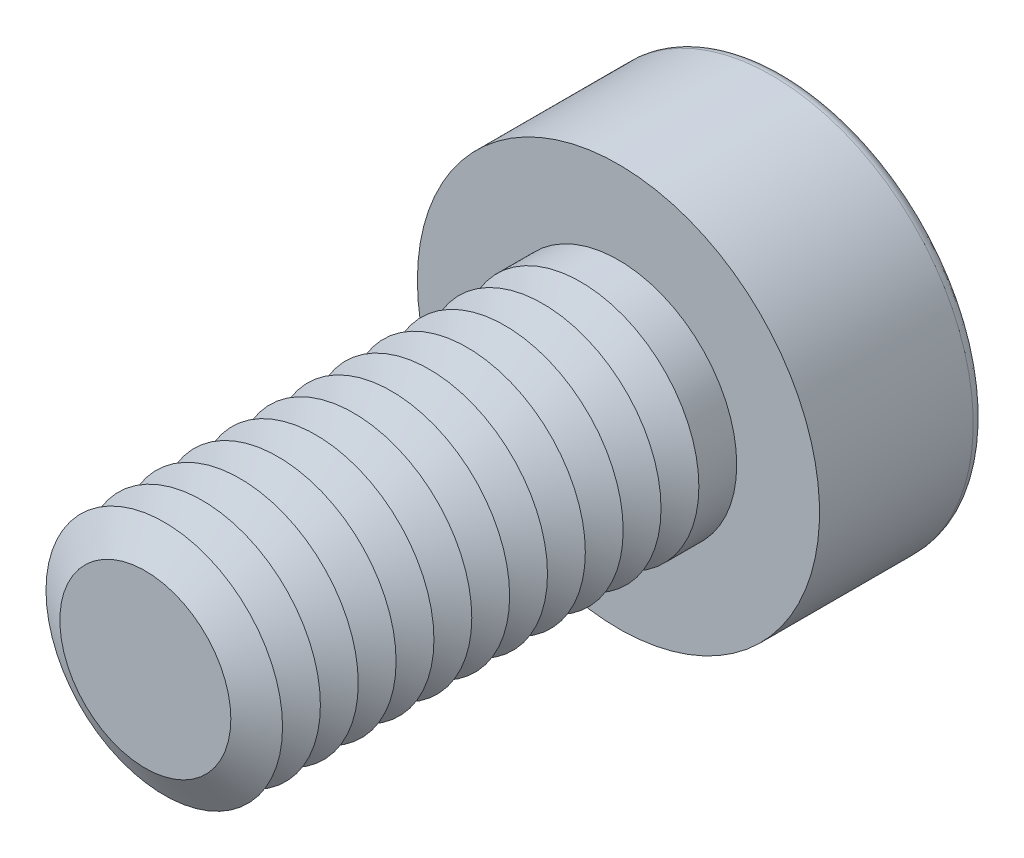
ISO-10303-21;
HEADER;
FILE_DESCRIPTION(('STEP AP214'),'2;1');
FILE_NAME('part.step','',(''),(''),'','','');
FILE_SCHEMA(('AUTOMOTIVE_DESIGN { 1 0 10303 214 1 1 1 1 }'));
ENDSEC;
DATA;
#1=APPLICATION_CONTEXT('core data for automotive mechanical design processes');
#2=APPLICATION_PROTOCOL_DEFINITION('international standard','automotive_design',2000,#1);
#3=PRODUCT_CONTEXT('',#1,'mechanical');
#4=PRODUCT('Part','Part','',(#3));
#5=PRODUCT_RELATED_PRODUCT_CATEGORY('part','',(#4));
#6=PRODUCT_DEFINITION_FORMATION('','',#4);
#7=PRODUCT_DEFINITION_CONTEXT('part definition',#1,'design');
#8=PRODUCT_DEFINITION('design','',#6,#7);
#9=PRODUCT_DEFINITION_SHAPE('','',#8);
#10=(LENGTH_UNIT() NAMED_UNIT(*) SI_UNIT(.MILLI.,.METRE.));
#11=(NAMED_UNIT(*) PLANE_ANGLE_UNIT() SI_UNIT($,.RADIAN.));
#12=(NAMED_UNIT(*) SI_UNIT($,.STERADIAN.) SOLID_ANGLE_UNIT());
#13=UNCERTAINTY_MEASURE_WITH_UNIT(LENGTH_MEASURE(1.E-05),#10,'distance_accuracy_value','');
#14=(GEOMETRIC_REPRESENTATION_CONTEXT(3) GLOBAL_UNCERTAINTY_ASSIGNED_CONTEXT((#13)) GLOBAL_UNIT_ASSIGNED_CONTEXT((#10,
#11,#12)) REPRESENTATION_CONTEXT('',''));
#15=CARTESIAN_POINT('',(0.,0.,0.));
#16=DIRECTION('',(0.,0.,1.));
#17=DIRECTION('',(1.,0.,0.));
#18=AXIS2_PLACEMENT_3D('',#15,#16,#17);
#19=CARTESIAN_POINT('',(0.,0.,7.2));
#20=DIRECTION('',(0.,0.,1.));
#21=DIRECTION('',(1.,0.,0.));
#22=AXIS2_PLACEMENT_3D('',#19,#20,#21);
#23=CONICAL_SURFACE('',#22,2.5,1.0471975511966);
#24=CARTESIAN_POINT('',(0.,0.,6.8));
#25=DIRECTION('',(0.,0.,1.));
#26=DIRECTION('',(1.,0.,0.));
#27=AXIS2_PLACEMENT_3D('',#24,#25,#26);
#28=CIRCLE('',#27,1.80717967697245);
#29=CARTESIAN_POINT('',(1.80717967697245,0.,6.8));
#30=VERTEX_POINT('',#29);
#31=EDGE_CURVE('E313',#30,#30,#28,.T.);
#32=ORIENTED_EDGE('',*,*,#31,.T.);
#33=EDGE_LOOP('',(#32));
#34=FACE_BOUND('',#33,.T.);
#35=CARTESIAN_POINT('',(0.,0.,7.2));
#36=DIRECTION('',(0.,0.,1.));
#37=DIRECTION('',(1.,0.,0.));
#38=AXIS2_PLACEMENT_3D('',#35,#36,#37);
#39=CIRCLE('',#38,2.5);
#40=CARTESIAN_POINT('',(2.5,0.,7.2));
#41=VERTEX_POINT('',#40);
#42=EDGE_CURVE('E316',#41,#41,#39,.T.);
#43=ORIENTED_EDGE('',*,*,#42,.F.);
#44=EDGE_LOOP('',(#43));
#45=FACE_BOUND('',#44,.T.);
#46=ADVANCED_FACE('F39',(#34,#45),#23,.T.);
#47=CARTESIAN_POINT('',(0.,0.,6.8));
#48=DIRECTION('',(0.,0.,-1.));
#49=DIRECTION('',(-1.,0.,0.));
#50=AXIS2_PLACEMENT_3D('',#47,#48,#49);
#51=CONICAL_SURFACE('',#50,1.80717967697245,1.0471975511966);
#52=CARTESIAN_POINT('',(0.,0.,6.4));
#53=DIRECTION('',(0.,0.,1.));
#54=DIRECTION('',(1.,0.,0.));
#55=AXIS2_PLACEMENT_3D('',#52,#53,#54);
#56=CIRCLE('',#55,2.5);
#57=CARTESIAN_POINT('',(2.5,0.,6.4));
#58=VERTEX_POINT('',#57);
#59=EDGE_CURVE('E324',#58,#58,#56,.T.);
#60=ORIENTED_EDGE('',*,*,#59,.T.);
#61=EDGE_LOOP('',(#60));
#62=FACE_BOUND('',#61,.T.);
#63=ORIENTED_EDGE('',*,*,#31,.F.);
#64=EDGE_LOOP('',(#63));
#65=FACE_BOUND('',#64,.T.);
#66=ADVANCED_FACE('F244',(#62,#65),#51,.T.);
#67=CARTESIAN_POINT('',(0.,0.,10.));
#68=DIRECTION('',(0.,0.,1.));
#69=DIRECTION('',(1.,0.,0.));
#70=AXIS2_PLACEMENT_3D('',#67,#68,#69);
#71=PLANE('',#70);
#72=CARTESIAN_POINT('',(0.,0.,10.));
#73=DIRECTION('',(0.,0.,1.));
#74=DIRECTION('',(1.,0.,0.));
#75=AXIS2_PLACEMENT_3D('',#72,#73,#74);
#76=CIRCLE('',#75,1.80717967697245);
#77=CARTESIAN_POINT('',(1.80717967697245,0.,10.));
#78=VERTEX_POINT('',#77);
#79=EDGE_CURVE('E173',#78,#78,#76,.T.);
#80=ORIENTED_EDGE('',*,*,#79,.T.);
#81=EDGE_LOOP('',(#80));
#82=FACE_BOUND('',#81,.T.);
#83=ADVANCED_FACE('F250',(#82),#71,.T.);
#84=CARTESIAN_POINT('',(0.,0.,10.));
#85=DIRECTION('',(0.,0.,-1.));
#86=DIRECTION('',(-1.,0.,0.));
#87=AXIS2_PLACEMENT_3D('',#84,#85,#86);
#88=CONICAL_SURFACE('',#87,1.80717967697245,1.0471975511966);
#89=CARTESIAN_POINT('',(0.,0.,9.6));
#90=DIRECTION('',(0.,0.,1.));
#91=DIRECTION('',(1.,0.,0.));
#92=AXIS2_PLACEMENT_3D('',#89,#90,#91);
#93=CIRCLE('',#92,2.5);
#94=CARTESIAN_POINT('',(2.5,0.,9.6));
#95=VERTEX_POINT('',#94);
#96=EDGE_CURVE('E290',#95,#95,#93,.T.);
#97=ORIENTED_EDGE('',*,*,#96,.T.);
#98=EDGE_LOOP('',(#97));
#99=FACE_BOUND('',#98,.T.);
#100=ORIENTED_EDGE('',*,*,#79,.F.);
#101=EDGE_LOOP('',(#100));
#102=FACE_BOUND('',#101,.T.);
#103=ADVANCED_FACE('F198',(#99,#102),#88,.T.);
#104=CARTESIAN_POINT('',(0.,0.,9.6));
#105=DIRECTION('',(0.,0.,1.));
#106=DIRECTION('',(1.,0.,0.));
#107=AXIS2_PLACEMENT_3D('',#104,#105,#106);
#108=CONICAL_SURFACE('',#107,2.5,1.0471975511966);
#109=CARTESIAN_POINT('',(0.,0.,9.2));
#110=DIRECTION('',(0.,0.,1.));
#111=DIRECTION('',(1.,0.,0.));
#112=AXIS2_PLACEMENT_3D('',#109,#110,#111);
#113=CIRCLE('',#112,1.80717967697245);
#114=CARTESIAN_POINT('',(1.80717967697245,0.,9.2));
#115=VERTEX_POINT('',#114);
#116=EDGE_CURVE('E287',#115,#115,#113,.T.);
#117=ORIENTED_EDGE('',*,*,#116,.T.);
#118=EDGE_LOOP('',(#117));
#119=FACE_BOUND('',#118,.T.);
#120=ORIENTED_EDGE('',*,*,#96,.F.);
#121=EDGE_LOOP('',(#120));
#122=FACE_BOUND('',#121,.T.);
#123=ADVANCED_FACE('F276',(#119,#122),#108,.T.);
#124=CARTESIAN_POINT('',(0.,0.,9.2));
#125=DIRECTION('',(0.,0.,-1.));
#126=DIRECTION('',(-1.,0.,0.));
#127=AXIS2_PLACEMENT_3D('',#124,#125,#126);
#128=CONICAL_SURFACE('',#127,1.80717967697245,1.0471975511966);
#129=CARTESIAN_POINT('',(0.,0.,8.8));
#130=DIRECTION('',(0.,0.,1.));
#131=DIRECTION('',(1.,0.,0.));
#132=AXIS2_PLACEMENT_3D('',#129,#130,#131);
#133=CIRCLE('',#132,2.5);
#134=CARTESIAN_POINT('',(2.5,0.,8.8));
#135=VERTEX_POINT('',#134);
#136=EDGE_CURVE('E299',#135,#135,#133,.T.);
#137=ORIENTED_EDGE('',*,*,#136,.T.);
#138=EDGE_LOOP('',(#137));
#139=FACE_BOUND('',#138,.T.);
#140=ORIENTED_EDGE('',*,*,#116,.F.);
#141=EDGE_LOOP('',(#140));
#142=FACE_BOUND('',#141,.T.);
#143=ADVANCED_FACE('F273',(#139,#142),#128,.T.);
#144=CARTESIAN_POINT('',(0.,0.,8.8));
#145=DIRECTION('',(0.,0.,1.));
#146=DIRECTION('',(1.,0.,0.));
#147=AXIS2_PLACEMENT_3D('',#144,#145,#146);
#148=CONICAL_SURFACE('',#147,2.5,1.0471975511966);
#149=CARTESIAN_POINT('',(0.,0.,8.4));
#150=DIRECTION('',(0.,0.,1.));
#151=DIRECTION('',(1.,0.,0.));
#152=AXIS2_PLACEMENT_3D('',#149,#150,#151);
#153=CIRCLE('',#152,1.80717967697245);
#154=CARTESIAN_POINT('',(1.80717967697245,0.,8.4));
#155=VERTEX_POINT('',#154);
#156=EDGE_CURVE('E292',#155,#155,#153,.T.);
#157=ORIENTED_EDGE('',*,*,#156,.T.);
#158=EDGE_LOOP('',(#157));
#159=FACE_BOUND('',#158,.T.);
#160=ORIENTED_EDGE('',*,*,#136,.F.);
#161=EDGE_LOOP('',(#160));
#162=FACE_BOUND('',#161,.T.);
#163=ADVANCED_FACE('F269',(#159,#162),#148,.T.);
#164=CARTESIAN_POINT('',(0.,0.,8.4));
#165=DIRECTION('',(0.,0.,-1.));
#166=DIRECTION('',(-1.,0.,0.));
#167=AXIS2_PLACEMENT_3D('',#164,#165,#166);
#168=CONICAL_SURFACE('',#167,1.80717967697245,1.0471975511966);
#169=CARTESIAN_POINT('',(0.,0.,8.));
#170=DIRECTION('',(0.,0.,1.));
#171=DIRECTION('',(1.,0.,0.));
#172=AXIS2_PLACEMENT_3D('',#169,#170,#171);
#173=CIRCLE('',#172,2.5);
#174=CARTESIAN_POINT('',(2.5,0.,8.));
#175=VERTEX_POINT('',#174);
#176=EDGE_CURVE('E309',#175,#175,#173,.T.);
#177=ORIENTED_EDGE('',*,*,#176,.T.);
#178=EDGE_LOOP('',(#177));
#179=FACE_BOUND('',#178,.T.);
#180=ORIENTED_EDGE('',*,*,#156,.F.);
#181=EDGE_LOOP('',(#180));
#182=FACE_BOUND('',#181,.T.);
#183=ADVANCED_FACE('F265',(#179,#182),#168,.T.);
#184=CARTESIAN_POINT('',(0.,0.,8.));
#185=DIRECTION('',(0.,0.,1.));
#186=DIRECTION('',(1.,0.,0.));
#187=AXIS2_PLACEMENT_3D('',#184,#185,#186);
#188=CONICAL_SURFACE('',#187,2.5,1.0471975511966);
#189=CARTESIAN_POINT('',(0.,0.,7.6));
#190=DIRECTION('',(0.,0.,1.));
#191=DIRECTION('',(1.,0.,0.));
#192=AXIS2_PLACEMENT_3D('',#189,#190,#191);
#193=CIRCLE('',#192,1.80717967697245);
#194=CARTESIAN_POINT('',(1.80717967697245,0.,7.6));
#195=VERTEX_POINT('',#194);
#196=EDGE_CURVE('E305',#195,#195,#193,.T.);
#197=ORIENTED_EDGE('',*,*,#196,.T.);
#198=EDGE_LOOP('',(#197));
#199=FACE_BOUND('',#198,.T.);
#200=ORIENTED_EDGE('',*,*,#176,.F.);
#201=EDGE_LOOP('',(#200));
#202=FACE_BOUND('',#201,.T.);
#203=ADVANCED_FACE('F261',(#199,#202),#188,.T.);
#204=CARTESIAN_POINT('',(0.,0.,7.6));
#205=DIRECTION('',(0.,0.,-1.));
#206=DIRECTION('',(-1.,0.,0.));
#207=AXIS2_PLACEMENT_3D('',#204,#205,#206);
#208=CONICAL_SURFACE('',#207,1.80717967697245,1.0471975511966);
#209=ORIENTED_EDGE('',*,*,#42,.T.);
#210=EDGE_LOOP('',(#209));
#211=FACE_BOUND('',#210,.T.);
#212=ORIENTED_EDGE('',*,*,#196,.F.);
#213=EDGE_LOOP('',(#212));
#214=FACE_BOUND('',#213,.T.);
#215=ADVANCED_FACE('F257',(#211,#214),#208,.T.);
#216=CARTESIAN_POINT('',(0.,0.,6.4));
#217=DIRECTION('',(0.,0.,1.));
#218=DIRECTION('',(1.,0.,0.));
#219=AXIS2_PLACEMENT_3D('',#216,#217,#218);
#220=CONICAL_SURFACE('',#219,2.5,1.0471975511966);
#221=CARTESIAN_POINT('',(0.,0.,6.));
#222=DIRECTION('',(0.,0.,1.));
#223=DIRECTION('',(1.,0.,0.));
#224=AXIS2_PLACEMENT_3D('',#221,#222,#223);
#225=CIRCLE('',#224,1.80717967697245);
#226=CARTESIAN_POINT('',(1.80717967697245,0.,6.));
#227=VERTEX_POINT('',#226);
#228=EDGE_CURVE('E320',#227,#227,#225,.T.);
#229=ORIENTED_EDGE('',*,*,#228,.T.);
#230=EDGE_LOOP('',(#229));
#231=FACE_BOUND('',#230,.T.);
#232=ORIENTED_EDGE('',*,*,#59,.F.);
#233=EDGE_LOOP('',(#232));
#234=FACE_BOUND('',#233,.T.);
#235=ADVANCED_FACE('F260',(#231,#234),#220,.T.);
#236=CARTESIAN_POINT('',(0.,0.,6.));
#237=DIRECTION('',(0.,0.,-1.));
#238=DIRECTION('',(-1.,0.,0.));
#239=AXIS2_PLACEMENT_3D('',#236,#237,#238);
#240=CONICAL_SURFACE('',#239,1.80717967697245,1.0471975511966);
#241=CARTESIAN_POINT('',(0.,0.,5.6));
#242=DIRECTION('',(0.,0.,1.));
#243=DIRECTION('',(1.,0.,0.));
#244=AXIS2_PLACEMENT_3D('',#241,#242,#243);
#245=CIRCLE('',#244,2.5);
#246=CARTESIAN_POINT('',(2.5,0.,5.6));
#247=VERTEX_POINT('',#246);
#248=EDGE_CURVE('E332',#247,#247,#245,.T.);
#249=ORIENTED_EDGE('',*,*,#248,.T.);
#250=EDGE_LOOP('',(#249));
#251=FACE_BOUND('',#250,.T.);
#252=ORIENTED_EDGE('',*,*,#228,.F.);
#253=EDGE_LOOP('',(#252));
#254=FACE_BOUND('',#253,.T.);
#255=ADVANCED_FACE('F431',(#251,#254),#240,.T.);
#256=CARTESIAN_POINT('',(0.,0.,5.6));
#257=DIRECTION('',(0.,0.,1.));
#258=DIRECTION('',(1.,0.,0.));
#259=AXIS2_PLACEMENT_3D('',#256,#257,#258);
#260=CONICAL_SURFACE('',#259,2.5,1.0471975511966);
#261=CARTESIAN_POINT('',(0.,0.,5.2));
#262=DIRECTION('',(0.,0.,1.));
#263=DIRECTION('',(1.,0.,0.));
#264=AXIS2_PLACEMENT_3D('',#261,#262,#263);
#265=CIRCLE('',#264,1.80717967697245);
#266=CARTESIAN_POINT('',(1.80717967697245,0.,5.2));
#267=VERTEX_POINT('',#266);
#268=EDGE_CURVE('E328',#267,#267,#265,.T.);
#269=ORIENTED_EDGE('',*,*,#268,.T.);
#270=EDGE_LOOP('',(#269));
#271=FACE_BOUND('',#270,.T.);
#272=ORIENTED_EDGE('',*,*,#248,.F.);
#273=EDGE_LOOP('',(#272));
#274=FACE_BOUND('',#273,.T.);
#275=ADVANCED_FACE('F427',(#271,#274),#260,.T.);
#276=CARTESIAN_POINT('',(0.,0.,5.2));
#277=DIRECTION('',(0.,0.,-1.));
#278=DIRECTION('',(-1.,0.,0.));
#279=AXIS2_PLACEMENT_3D('',#276,#277,#278);
#280=CONICAL_SURFACE('',#279,1.80717967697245,1.0471975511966);
#281=CARTESIAN_POINT('',(0.,0.,4.8));
#282=DIRECTION('',(0.,0.,1.));
#283=DIRECTION('',(1.,0.,0.));
#284=AXIS2_PLACEMENT_3D('',#281,#282,#283);
#285=CIRCLE('',#284,2.5);
#286=CARTESIAN_POINT('',(2.5,0.,4.8));
#287=VERTEX_POINT('',#286);
#288=EDGE_CURVE('E340',#287,#287,#285,.T.);
#289=ORIENTED_EDGE('',*,*,#288,.T.);
#290=EDGE_LOOP('',(#289));
#291=FACE_BOUND('',#290,.T.);
#292=ORIENTED_EDGE('',*,*,#268,.F.);
#293=EDGE_LOOP('',(#292));
#294=FACE_BOUND('',#293,.T.);
#295=ADVANCED_FACE('F423',(#291,#294),#280,.T.);
#296=CARTESIAN_POINT('',(0.,0.,4.8));
#297=DIRECTION('',(0.,0.,1.));
#298=DIRECTION('',(1.,0.,0.));
#299=AXIS2_PLACEMENT_3D('',#296,#297,#298);
#300=CONICAL_SURFACE('',#299,2.5,1.0471975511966);
#301=CARTESIAN_POINT('',(0.,0.,4.4));
#302=DIRECTION('',(0.,0.,1.));
#303=DIRECTION('',(1.,0.,0.));
#304=AXIS2_PLACEMENT_3D('',#301,#302,#303);
#305=CIRCLE('',#304,1.80717967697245);
#306=CARTESIAN_POINT('',(1.80717967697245,0.,4.4));
#307=VERTEX_POINT('',#306);
#308=EDGE_CURVE('E336',#307,#307,#305,.T.);
#309=ORIENTED_EDGE('',*,*,#308,.T.);
#310=EDGE_LOOP('',(#309));
#311=FACE_BOUND('',#310,.T.);
#312=ORIENTED_EDGE('',*,*,#288,.F.);
#313=EDGE_LOOP('',(#312));
#314=FACE_BOUND('',#313,.T.);
#315=ADVANCED_FACE('F419',(#311,#314),#300,.T.);
#316=CARTESIAN_POINT('',(0.,0.,4.4));
#317=DIRECTION('',(0.,0.,-1.));
#318=DIRECTION('',(-1.,0.,0.));
#319=AXIS2_PLACEMENT_3D('',#316,#317,#318);
#320=CONICAL_SURFACE('',#319,1.80717967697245,1.0471975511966);
#321=CARTESIAN_POINT('',(0.,0.,4.));
#322=DIRECTION('',(0.,0.,1.));
#323=DIRECTION('',(1.,0.,0.));
#324=AXIS2_PLACEMENT_3D('',#321,#322,#323);
#325=CIRCLE('',#324,2.5);
#326=CARTESIAN_POINT('',(2.5,0.,4.));
#327=VERTEX_POINT('',#326);
#328=EDGE_CURVE('E348',#327,#327,#325,.T.);
#329=ORIENTED_EDGE('',*,*,#328,.T.);
#330=EDGE_LOOP('',(#329));
#331=FACE_BOUND('',#330,.T.);
#332=ORIENTED_EDGE('',*,*,#308,.F.);
#333=EDGE_LOOP('',(#332));
#334=FACE_BOUND('',#333,.T.);
#335=ADVANCED_FACE('F415',(#331,#334),#320,.T.);
#336=CARTESIAN_POINT('',(0.,0.,4.));
#337=DIRECTION('',(0.,0.,1.));
#338=DIRECTION('',(1.,0.,0.));
#339=AXIS2_PLACEMENT_3D('',#336,#337,#338);
#340=CONICAL_SURFACE('',#339,2.5,1.0471975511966);
#341=CARTESIAN_POINT('',(0.,0.,3.6));
#342=DIRECTION('',(0.,0.,1.));
#343=DIRECTION('',(1.,0.,0.));
#344=AXIS2_PLACEMENT_3D('',#341,#342,#343);
#345=CIRCLE('',#344,1.80717967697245);
#346=CARTESIAN_POINT('',(1.80717967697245,0.,3.6));
#347=VERTEX_POINT('',#346);
#348=EDGE_CURVE('E344',#347,#347,#345,.T.);
#349=ORIENTED_EDGE('',*,*,#348,.T.);
#350=EDGE_LOOP('',(#349));
#351=FACE_BOUND('',#350,.T.);
#352=ORIENTED_EDGE('',*,*,#328,.F.);
#353=EDGE_LOOP('',(#352));
#354=FACE_BOUND('',#353,.T.);
#355=ADVANCED_FACE('F411',(#351,#354),#340,.T.);
#356=CARTESIAN_POINT('',(0.,0.,3.6));
#357=DIRECTION('',(0.,0.,-1.));
#358=DIRECTION('',(-1.,0.,0.));
#359=AXIS2_PLACEMENT_3D('',#356,#357,#358);
#360=CONICAL_SURFACE('',#359,1.80717967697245,1.0471975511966);
#361=CARTESIAN_POINT('',(0.,0.,3.2));
#362=DIRECTION('',(0.,0.,1.));
#363=DIRECTION('',(1.,0.,0.));
#364=AXIS2_PLACEMENT_3D('',#361,#362,#363);
#365=CIRCLE('',#364,2.5);
#366=CARTESIAN_POINT('',(2.5,0.,3.2));
#367=VERTEX_POINT('',#366);
#368=EDGE_CURVE('E356',#367,#367,#365,.T.);
#369=ORIENTED_EDGE('',*,*,#368,.T.);
#370=EDGE_LOOP('',(#369));
#371=FACE_BOUND('',#370,.T.);
#372=ORIENTED_EDGE('',*,*,#348,.F.);
#373=EDGE_LOOP('',(#372));
#374=FACE_BOUND('',#373,.T.);
#375=ADVANCED_FACE('F407',(#371,#374),#360,.T.);
#376=CARTESIAN_POINT('',(0.,0.,3.2));
#377=DIRECTION('',(0.,0.,1.));
#378=DIRECTION('',(1.,0.,0.));
#379=AXIS2_PLACEMENT_3D('',#376,#377,#378);
#380=CONICAL_SURFACE('',#379,2.5,1.0471975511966);
#381=CARTESIAN_POINT('',(0.,0.,2.8));
#382=DIRECTION('',(0.,0.,1.));
#383=DIRECTION('',(1.,0.,0.));
#384=AXIS2_PLACEMENT_3D('',#381,#382,#383);
#385=CIRCLE('',#384,1.80717967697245);
#386=CARTESIAN_POINT('',(1.80717967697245,0.,2.8));
#387=VERTEX_POINT('',#386);
#388=EDGE_CURVE('E352',#387,#387,#385,.T.);
#389=ORIENTED_EDGE('',*,*,#388,.T.);
#390=EDGE_LOOP('',(#389));
#391=FACE_BOUND('',#390,.T.);
#392=ORIENTED_EDGE('',*,*,#368,.F.);
#393=EDGE_LOOP('',(#392));
#394=FACE_BOUND('',#393,.T.);
#395=ADVANCED_FACE('F403',(#391,#394),#380,.T.);
#396=CARTESIAN_POINT('',(0.,0.,2.8));
#397=DIRECTION('',(0.,0.,-1.));
#398=DIRECTION('',(-1.,0.,0.));
#399=AXIS2_PLACEMENT_3D('',#396,#397,#398);
#400=CONICAL_SURFACE('',#399,1.80717967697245,1.0471975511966);
#401=CARTESIAN_POINT('',(0.,0.,2.4));
#402=DIRECTION('',(0.,0.,1.));
#403=DIRECTION('',(1.,0.,0.));
#404=AXIS2_PLACEMENT_3D('',#401,#402,#403);
#405=CIRCLE('',#404,2.5);
#406=CARTESIAN_POINT('',(2.5,0.,2.4));
#407=VERTEX_POINT('',#406);
#408=EDGE_CURVE('E363',#407,#407,#405,.T.);
#409=ORIENTED_EDGE('',*,*,#408,.T.);
#410=EDGE_LOOP('',(#409));
#411=FACE_BOUND('',#410,.T.);
#412=ORIENTED_EDGE('',*,*,#388,.F.);
#413=EDGE_LOOP('',(#412));
#414=FACE_BOUND('',#413,.T.);
#415=ADVANCED_FACE('F399',(#411,#414),#400,.T.);
#416=CARTESIAN_POINT('',(0.,0.,2.4));
#417=DIRECTION('',(0.,0.,1.));
#418=DIRECTION('',(1.,0.,0.));
#419=AXIS2_PLACEMENT_3D('',#416,#417,#418);
#420=CONICAL_SURFACE('',#419,2.5,1.0471975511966);
#421=CARTESIAN_POINT('',(0.,0.,2.));
#422=DIRECTION('',(0.,0.,1.));
#423=DIRECTION('',(1.,0.,0.));
#424=AXIS2_PLACEMENT_3D('',#421,#422,#423);
#425=CIRCLE('',#424,1.80717967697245);
#426=CARTESIAN_POINT('',(1.80717967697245,0.,2.));
#427=VERTEX_POINT('',#426);
#428=EDGE_CURVE('E360',#427,#427,#425,.T.);
#429=ORIENTED_EDGE('',*,*,#428,.T.);
#430=EDGE_LOOP('',(#429));
#431=FACE_BOUND('',#430,.T.);
#432=ORIENTED_EDGE('',*,*,#408,.F.);
#433=EDGE_LOOP('',(#432));
#434=FACE_BOUND('',#433,.T.);
#435=ADVANCED_FACE('F394',(#431,#434),#420,.T.);
#436=CARTESIAN_POINT('',(0.,0.,2.));
#437=DIRECTION('',(0.,0.,-1.));
#438=DIRECTION('',(-1.,0.,0.));
#439=AXIS2_PLACEMENT_3D('',#436,#437,#438);
#440=CONICAL_SURFACE('',#439,1.80717967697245,1.0471975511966);
#441=CARTESIAN_POINT('',(0.,0.,1.6));
#442=DIRECTION('',(0.,0.,1.));
#443=DIRECTION('',(1.,0.,0.));
#444=AXIS2_PLACEMENT_3D('',#441,#442,#443);
#445=CIRCLE('',#444,2.5);
#446=CARTESIAN_POINT('',(2.5,0.,1.6));
#447=VERTEX_POINT('',#446);
#448=EDGE_CURVE('E375',#447,#447,#445,.T.);
#449=ORIENTED_EDGE('',*,*,#448,.T.);
#450=EDGE_LOOP('',(#449));
#451=FACE_BOUND('',#450,.T.);
#452=ORIENTED_EDGE('',*,*,#428,.F.);
#453=EDGE_LOOP('',(#452));
#454=FACE_BOUND('',#453,.T.);
#455=ADVANCED_FACE('F380',(#451,#454),#440,.T.);
#456=CARTESIAN_POINT('',(0.,0.,1.6));
#457=DIRECTION('',(0.,0.,1.));
#458=DIRECTION('',(1.,0.,0.));
#459=AXIS2_PLACEMENT_3D('',#456,#457,#458);
#460=CONICAL_SURFACE('',#459,2.5,1.0471975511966);
#461=CARTESIAN_POINT('',(0.,0.,1.2));
#462=DIRECTION('',(0.,0.,1.));
#463=DIRECTION('',(1.,0.,0.));
#464=AXIS2_PLACEMENT_3D('',#461,#462,#463);
#465=CIRCLE('',#464,1.80717967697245);
#466=CARTESIAN_POINT('',(1.80717967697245,0.,1.2));
#467=VERTEX_POINT('',#466);
#468=EDGE_CURVE('E367',#467,#467,#465,.T.);
#469=ORIENTED_EDGE('',*,*,#468,.T.);
#470=EDGE_LOOP('',(#469));
#471=FACE_BOUND('',#470,.T.);
#472=ORIENTED_EDGE('',*,*,#448,.F.);
#473=EDGE_LOOP('',(#472));
#474=FACE_BOUND('',#473,.T.);
#475=ADVANCED_FACE('F383',(#471,#474),#460,.T.);
#476=CARTESIAN_POINT('',(0.,0.,1.2));
#477=DIRECTION('',(0.,0.,-1.));
#478=DIRECTION('',(-1.,0.,0.));
#479=AXIS2_PLACEMENT_3D('',#476,#477,#478);
#480=CONICAL_SURFACE('',#479,1.80717967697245,1.0471975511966);
#481=CARTESIAN_POINT('',(0.,0.,0.8));
#482=DIRECTION('',(0.,0.,1.));
#483=DIRECTION('',(1.,0.,0.));
#484=AXIS2_PLACEMENT_3D('',#481,#482,#483);
#485=CIRCLE('',#484,2.5);
#486=CARTESIAN_POINT('',(2.5,0.,0.8));
#487=VERTEX_POINT('',#486);
#488=EDGE_CURVE('E371',#487,#487,#485,.T.);
#489=ORIENTED_EDGE('',*,*,#488,.T.);
#490=EDGE_LOOP('',(#489));
#491=FACE_BOUND('',#490,.T.);
#492=ORIENTED_EDGE('',*,*,#468,.F.);
#493=EDGE_LOOP('',(#492));
#494=FACE_BOUND('',#493,.T.);
#495=ADVANCED_FACE('F385',(#491,#494),#480,.T.);
#496=CARTESIAN_POINT('',(0.,0.,-1.25));
#497=DIRECTION('',(0.,0.,-1.));
#498=DIRECTION('',(-1.,0.,0.));
#499=AXIS2_PLACEMENT_3D('',#496,#497,#498);
#500=CONICAL_SURFACE('',#499,1.5,1.0471975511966);
#501=CARTESIAN_POINT('',(0.,0.,-0.383974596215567));
#502=VERTEX_POINT('',#501);
#503=VERTEX_LOOP('',#502);
#504=FACE_BOUND('',#503,.T.);
#505=CARTESIAN_POINT('',(0.,0.,-1.25));
#506=DIRECTION('',(0.,0.,-1.));
#507=DIRECTION('',(-1.,0.,0.));
#508=AXIS2_PLACEMENT_3D('',#505,#506,#507);
#509=CIRCLE('',#508,1.5);
#510=CARTESIAN_POINT('',(-1.29903810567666,0.749999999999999,-1.25));
#511=VERTEX_POINT('',#510);
#512=CARTESIAN_POINT('',(0.,1.5,-1.25));
#513=VERTEX_POINT('',#512);
#514=EDGE_CURVE('E149',#511,#513,#509,.T.);
#515=ORIENTED_EDGE('',*,*,#514,.T.);
#516=CARTESIAN_POINT('',(0.,0.,-1.25));
#517=DIRECTION('',(0.,0.,-1.));
#518=DIRECTION('',(-1.,0.,0.));
#519=AXIS2_PLACEMENT_3D('',#516,#517,#518);
#520=CIRCLE('',#519,1.5);
#521=CARTESIAN_POINT('',(1.29903810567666,0.75,-1.25));
#522=VERTEX_POINT('',#521);
#523=EDGE_CURVE('E54',#513,#522,#520,.T.);
#524=ORIENTED_EDGE('',*,*,#523,.T.);
#525=CARTESIAN_POINT('',(1.29903810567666,-0.75,-1.25));
#526=VERTEX_POINT('',#525);
#527=EDGE_CURVE('E876',#522,#526,#520,.T.);
#528=ORIENTED_EDGE('',*,*,#527,.T.);
#529=CARTESIAN_POINT('',(0.,-1.5,-1.25));
#530=VERTEX_POINT('',#529);
#531=EDGE_CURVE('E874',#526,#530,#520,.T.);
#532=ORIENTED_EDGE('',*,*,#531,.T.);
#533=CARTESIAN_POINT('',(-1.29903810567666,-0.749999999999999,-1.25));
#534=VERTEX_POINT('',#533);
#535=EDGE_CURVE('E868',#530,#534,#520,.T.);
#536=ORIENTED_EDGE('',*,*,#535,.T.);
#537=EDGE_CURVE('E866',#534,#511,#520,.T.);
#538=ORIENTED_EDGE('',*,*,#537,.T.);
#539=EDGE_LOOP('',(#515,#524,#528,#532,#536,#538));
#540=FACE_BOUND('',#539,.T.);
#541=ADVANCED_FACE('F200',(#504,#540),#500,.F.);
#542=CARTESIAN_POINT('',(0.,0.,-1.25));
#543=DIRECTION('',(0.,0.,-1.));
#544=DIRECTION('',(-1.,0.,0.));
#545=AXIS2_PLACEMENT_3D('',#542,#543,#544);
#546=PLANE('',#545);
#547=ORIENTED_EDGE('',*,*,#523,.F.);
#548=DIRECTION('',(1.,0.,0.));
#549=VECTOR('',#548,1.);
#550=CARTESIAN_POINT('',(-0.866025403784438,1.5,-1.25));
#551=LINE('',#550,#549);
#552=CARTESIAN_POINT('',(0.86602540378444,1.5,-1.25));
#553=VERTEX_POINT('',#552);
#554=EDGE_CURVE('E916',#513,#553,#551,.T.);
#555=ORIENTED_EDGE('',*,*,#554,.T.);
#556=DIRECTION('',(0.5,-0.866025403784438,0.));
#557=VECTOR('',#556,1.);
#558=CARTESIAN_POINT('',(0.86602540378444,1.5,-1.25));
#559=LINE('',#558,#557);
#560=EDGE_CURVE('E155',#553,#522,#559,.T.);
#561=ORIENTED_EDGE('',*,*,#560,.T.);
#562=EDGE_LOOP('',(#547,#555,#561));
#563=FACE_BOUND('',#562,.T.);
#564=ADVANCED_FACE('F496',(#563),#546,.T.);
#565=ORIENTED_EDGE('',*,*,#527,.F.);
#566=CARTESIAN_POINT('',(1.73205080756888,0.,-1.25));
#567=VERTEX_POINT('',#566);
#568=EDGE_CURVE('E915',#522,#567,#559,.T.);
#569=ORIENTED_EDGE('',*,*,#568,.T.);
#570=DIRECTION('',(-0.5,-0.866025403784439,0.));
#571=VECTOR('',#570,1.);
#572=CARTESIAN_POINT('',(1.73205080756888,0.,-1.25));
#573=LINE('',#572,#571);
#574=EDGE_CURVE('E888',#567,#526,#573,.T.);
#575=ORIENTED_EDGE('',*,*,#574,.T.);
#576=EDGE_LOOP('',(#565,#569,#575));
#577=FACE_BOUND('',#576,.T.);
#578=ADVANCED_FACE('F506',(#577),#546,.T.);
#579=ORIENTED_EDGE('',*,*,#531,.F.);
#580=CARTESIAN_POINT('',(0.86602540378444,-1.5,-1.25));
#581=VERTEX_POINT('',#580);
#582=EDGE_CURVE('E890',#526,#581,#573,.T.);
#583=ORIENTED_EDGE('',*,*,#582,.T.);
#584=DIRECTION('',(-1.,0.,0.));
#585=VECTOR('',#584,1.);
#586=CARTESIAN_POINT('',(0.86602540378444,-1.5,-1.25));
#587=LINE('',#586,#585);
#588=EDGE_CURVE('E842',#581,#530,#587,.T.);
#589=ORIENTED_EDGE('',*,*,#588,.T.);
#590=EDGE_LOOP('',(#579,#583,#589));
#591=FACE_BOUND('',#590,.T.);
#592=ADVANCED_FACE('F516',(#591),#546,.T.);
#593=ORIENTED_EDGE('',*,*,#535,.F.);
#594=CARTESIAN_POINT('',(-0.866025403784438,-1.5,-1.25));
#595=VERTEX_POINT('',#594);
#596=EDGE_CURVE('E885',#530,#595,#587,.T.);
#597=ORIENTED_EDGE('',*,*,#596,.T.);
#598=DIRECTION('',(-0.5,0.866025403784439,0.));
#599=VECTOR('',#598,1.);
#600=CARTESIAN_POINT('',(-0.866025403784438,-1.5,-1.25));
#601=LINE('',#600,#599);
#602=EDGE_CURVE('E887',#595,#534,#601,.T.);
#603=ORIENTED_EDGE('',*,*,#602,.T.);
#604=EDGE_LOOP('',(#593,#597,#603));
#605=FACE_BOUND('',#604,.T.);
#606=ADVANCED_FACE('F524',(#605),#546,.T.);
#607=ORIENTED_EDGE('',*,*,#537,.F.);
#608=CARTESIAN_POINT('',(-1.73205080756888,0.,-1.25));
#609=VERTEX_POINT('',#608);
#610=EDGE_CURVE('E891',#534,#609,#601,.T.);
#611=ORIENTED_EDGE('',*,*,#610,.T.);
#612=DIRECTION('',(0.5,0.866025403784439,0.));
#613=VECTOR('',#612,1.);
#614=CARTESIAN_POINT('',(-1.73205080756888,0.,-1.25));
#615=LINE('',#614,#613);
#616=EDGE_CURVE('E158',#609,#511,#615,.T.);
#617=ORIENTED_EDGE('',*,*,#616,.T.);
#618=EDGE_LOOP('',(#607,#611,#617));
#619=FACE_BOUND('',#618,.T.);
#620=ADVANCED_FACE('F230',(#619),#546,.T.);
#621=ORIENTED_EDGE('',*,*,#514,.F.);
#622=CARTESIAN_POINT('',(-0.866025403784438,1.5,-1.25));
#623=VERTEX_POINT('',#622);
#624=EDGE_CURVE('E897',#511,#623,#615,.T.);
#625=ORIENTED_EDGE('',*,*,#624,.T.);
#626=EDGE_CURVE('E913',#623,#513,#551,.T.);
#627=ORIENTED_EDGE('',*,*,#626,.T.);
#628=EDGE_LOOP('',(#621,#625,#627));
#629=FACE_BOUND('',#628,.T.);
#630=ADVANCED_FACE('F508',(#629),#546,.T.);
#631=CARTESIAN_POINT('',(-0.866025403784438,1.5,-1.25));
#632=DIRECTION('',(0.,1.,0.));
#633=DIRECTION('',(-1.,0.,0.));
#634=AXIS2_PLACEMENT_3D('',#631,#632,#633);
#635=PLANE('',#634);
#636=DIRECTION('',(0.,0.,-1.));
#637=VECTOR('',#636,1.);
#638=CARTESIAN_POINT('',(-0.866025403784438,1.5,-1.25));
#639=LINE('',#638,#637);
#640=CARTESIAN_POINT('',(-0.866025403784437,1.5,-3.5));
#641=VERTEX_POINT('',#640);
#642=EDGE_CURVE('E147',#623,#641,#639,.T.);
#643=ORIENTED_EDGE('',*,*,#642,.T.);
#644=CARTESIAN_POINT('',(-2.26080568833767,1.5,-3.76288767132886));
#645=CARTESIAN_POINT('',(-2.19307335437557,1.5,-3.74776718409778));
#646=CARTESIAN_POINT('',(-2.12529797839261,1.5,-3.73283936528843));
#647=CARTESIAN_POINT('',(-1.989639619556,1.5,-3.7034664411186));
#648=CARTESIAN_POINT('',(-1.92175663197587,1.5,-3.6890213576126));
#649=CARTESIAN_POINT('',(-1.71778516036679,1.5,-3.6465295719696));
#650=CARTESIAN_POINT('',(-1.58151166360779,1.5,-3.61935744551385));
#651=CARTESIAN_POINT('',(-1.30947840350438,1.5,-3.56878855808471));
#652=CARTESIAN_POINT('',(-1.17372447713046,1.5,-3.54536102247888));
#653=CARTESIAN_POINT('',(-0.90140428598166,1.5,-3.50385032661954));
#654=CARTESIAN_POINT('',(-0.764838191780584,1.5,-3.48576608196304));
#655=CARTESIAN_POINT('',(-0.489293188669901,1.5,-3.45729203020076));
#656=CARTESIAN_POINT('',(-0.350304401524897,1.5,-3.44699084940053));
#657=CARTESIAN_POINT('',(-0.14157144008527,1.5,-3.43918165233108));
#658=CARTESIAN_POINT('',(-0.0719628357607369,1.5,-3.43785196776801));
#659=CARTESIAN_POINT('',(0.0672555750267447,1.5,-3.43779336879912));
#660=CARTESIAN_POINT('',(0.136865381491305,1.5,-3.43906445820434));
#661=CARTESIAN_POINT('',(0.346114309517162,1.5,-3.44672257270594));
#662=CARTESIAN_POINT('',(0.48561964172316,1.5,-3.45697478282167));
#663=CARTESIAN_POINT('',(0.76382969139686,1.5,-3.48560011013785));
#664=CARTESIAN_POINT('',(0.902533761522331,1.5,-3.50397905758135));
#665=CARTESIAN_POINT('',(1.18270277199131,1.5,-3.54677522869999));
#666=CARTESIAN_POINT('',(1.32414472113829,1.5,-3.57133816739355));
#667=CARTESIAN_POINT('',(1.60634089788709,1.5,-3.62417713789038));
#668=CARTESIAN_POINT('',(1.74709501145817,1.5,-3.65245376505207));
#669=CARTESIAN_POINT('',(2.02813527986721,1.5,-3.71141289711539));
#670=CARTESIAN_POINT('',(2.16842128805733,1.5,-3.74209609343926));
#671=CARTESIAN_POINT('',(2.44863558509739,1.5,-3.80505759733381));
#672=CARTESIAN_POINT('',(2.5885638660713,1.5,-3.8373359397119));
#673=CARTESIAN_POINT('',(2.86645602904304,1.5,-3.90258693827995));
#674=CARTESIAN_POINT('',(3.0044230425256,1.5,-3.93554631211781));
#675=CARTESIAN_POINT('',(3.28017563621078,1.5,-4.00222717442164));
#676=CARTESIAN_POINT('',(3.41796121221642,1.5,-4.03594868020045));
#677=CARTESIAN_POINT('',(3.69320305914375,1.5,-4.10389962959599));
#678=CARTESIAN_POINT('',(3.83065952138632,1.5,-4.13812829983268));
#679=CARTESIAN_POINT('',(4.10546119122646,1.5,-4.20700872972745));
#680=CARTESIAN_POINT('',(4.24280640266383,1.5,-4.2416604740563));
#681=CARTESIAN_POINT('',(4.38011382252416,1.5,-4.27645965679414));
#682=B_SPLINE_CURVE_WITH_KNOTS('',3,(#644,#645,#646,#647,#648,#649,#650,#651,#652,#653,#654,
#655,#656,#657,#658,#659,#660,#661,#662,#663,#664,#665,#666,#667,#668,#669,#670,#671,#672,#673,
#674,#675,#676,#677,#678,#679,#680,#681),.UNSPECIFIED.,.F.,.F.,(4,2,2,2,2,2,2,2,2,2,2,2,2,2,2,2,
2,2,4),(0.,0.208198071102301,0.416405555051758,0.833243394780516,1.2464565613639,
1.65958581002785,2.07735129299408,2.28617008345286,2.49498917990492,2.91428402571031,
3.33388016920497,3.76448033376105,4.19514961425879,4.62594308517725,5.05674596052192,
5.48229088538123,5.90784548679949,6.33280701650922,6.75775319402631),.UNSPECIFIED.);
#683=CARTESIAN_POINT('',(0.866025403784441,1.5,-3.5));
#684=VERTEX_POINT('',#683);
#685=EDGE_CURVE('E124',#641,#684,#682,.T.);
#686=ORIENTED_EDGE('',*,*,#685,.T.);
#687=DIRECTION('',(0.,0.,-1.));
#688=VECTOR('',#687,1.);
#689=CARTESIAN_POINT('',(0.86602540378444,1.5,-1.25));
#690=LINE('',#689,#688);
#691=EDGE_CURVE('E143',#553,#684,#690,.T.);
#692=ORIENTED_EDGE('',*,*,#691,.F.);
#693=ORIENTED_EDGE('',*,*,#554,.F.);
#694=ORIENTED_EDGE('',*,*,#626,.F.);
#695=EDGE_LOOP('',(#643,#686,#692,#693,#694));
#696=FACE_BOUND('',#695,.T.);
#697=ADVANCED_FACE('F141',(#696),#635,.F.);
#698=CARTESIAN_POINT('',(0.86602540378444,1.5,-1.25));
#699=DIRECTION('',(0.866025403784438,0.5,0.));
#700=DIRECTION('',(-0.5,0.866025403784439,0.));
#701=AXIS2_PLACEMENT_3D('',#698,#699,#700);
#702=PLANE('',#701);
#703=ORIENTED_EDGE('',*,*,#691,.T.);
#704=CARTESIAN_POINT('',(0.865909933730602,1.5002,-3.50003094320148));
#705=CARTESIAN_POINT('',(0.901883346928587,1.43789222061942,-3.49038632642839));
#706=CARTESIAN_POINT('',(0.937921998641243,1.37547144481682,-3.48163049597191));
#707=CARTESIAN_POINT('',(1.01012661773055,1.25040937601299,-3.46624719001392));
#708=CARTESIAN_POINT('',(1.04629263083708,1.18776800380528,-3.4596205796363));
#709=CARTESIAN_POINT('',(1.11853262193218,1.06264466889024,-3.44888268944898));
#710=CARTESIAN_POINT('',(1.15460611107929,1.00016355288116,-3.44475860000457));
#711=CARTESIAN_POINT('',(1.22679910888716,0.875121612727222,-3.43922860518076));
#712=CARTESIAN_POINT('',(1.26291860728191,0.812560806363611,-3.43782217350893));
#713=CARTESIAN_POINT('',(1.33515760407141,0.68743919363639,-3.43782217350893));
#714=CARTESIAN_POINT('',(1.37127710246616,0.62487838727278,-3.43922860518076));
#715=CARTESIAN_POINT('',(1.44347010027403,0.49983644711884,-3.44475860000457));
#716=CARTESIAN_POINT('',(1.47954358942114,0.437355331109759,-3.44888268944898));
#717=CARTESIAN_POINT('',(1.55178358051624,0.312231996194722,-3.4596205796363));
#718=CARTESIAN_POINT('',(1.58794959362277,0.249590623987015,-3.46624719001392));
#719=CARTESIAN_POINT('',(1.66015421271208,0.124528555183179,-3.48163049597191));
#720=CARTESIAN_POINT('',(1.69619286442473,0.0621077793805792,-3.49038632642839));
#721=CARTESIAN_POINT('',(1.73216627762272,-0.000199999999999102,-3.50003094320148));
#722=B_SPLINE_CURVE_WITH_KNOTS('',3,(#704,#705,#706,#707,#708,#709,#710,#711,#712,#713,#714,
#715,#716,#717,#718,#719,#720,#721),.UNSPECIFIED.,.F.,.F.,(4,2,2,2,2,2,2,2,4),(0.,
0.217782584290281,0.435653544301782,0.652399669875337,0.869103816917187,1.08580796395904,
1.30255408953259,1.52042504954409,1.73820763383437),.UNSPECIFIED.);
#723=CARTESIAN_POINT('',(1.73205080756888,0.,-3.5));
#724=VERTEX_POINT('',#723);
#725=EDGE_CURVE('E11',#684,#724,#722,.T.);
#726=ORIENTED_EDGE('',*,*,#725,.T.);
#727=DIRECTION('',(0.,0.,-1.));
#728=VECTOR('',#727,1.);
#729=CARTESIAN_POINT('',(1.73205080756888,0.,-1.25));
#730=LINE('',#729,#728);
#731=EDGE_CURVE('E157',#567,#724,#730,.T.);
#732=ORIENTED_EDGE('',*,*,#731,.F.);
#733=ORIENTED_EDGE('',*,*,#568,.F.);
#734=ORIENTED_EDGE('',*,*,#560,.F.);
#735=EDGE_LOOP('',(#703,#726,#732,#733,#734));
#736=FACE_BOUND('',#735,.T.);
#737=ADVANCED_FACE('F152',(#736),#702,.F.);
#738=CARTESIAN_POINT('',(1.73205080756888,0.,-1.25));
#739=DIRECTION('',(0.866025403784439,-0.5,0.));
#740=DIRECTION('',(0.5,0.866025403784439,0.));
#741=AXIS2_PLACEMENT_3D('',#738,#739,#740);
#742=PLANE('',#741);
#743=ORIENTED_EDGE('',*,*,#731,.T.);
#744=CARTESIAN_POINT('',(1.73216627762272,0.000200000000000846,-3.50003094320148));
#745=CARTESIAN_POINT('',(1.69619286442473,-0.0621077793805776,-3.49038632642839));
#746=CARTESIAN_POINT('',(1.66015421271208,-0.124528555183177,-3.48163049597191));
#747=CARTESIAN_POINT('',(1.58794959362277,-0.249590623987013,-3.46624719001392));
#748=CARTESIAN_POINT('',(1.55178358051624,-0.312231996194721,-3.4596205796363));
#749=CARTESIAN_POINT('',(1.47954358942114,-0.437355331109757,-3.44888268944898));
#750=CARTESIAN_POINT('',(1.44347010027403,-0.499836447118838,-3.44475860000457));
#751=CARTESIAN_POINT('',(1.37127710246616,-0.624878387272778,-3.43922860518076));
#752=CARTESIAN_POINT('',(1.33515760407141,-0.687439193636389,-3.43782217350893));
#753=CARTESIAN_POINT('',(1.26291860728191,-0.81256080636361,-3.43782217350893));
#754=CARTESIAN_POINT('',(1.22679910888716,-0.87512161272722,-3.43922860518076));
#755=CARTESIAN_POINT('',(1.15460611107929,-1.00016355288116,-3.44475860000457));
#756=CARTESIAN_POINT('',(1.11853262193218,-1.06264466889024,-3.44888268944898));
#757=CARTESIAN_POINT('',(1.04629263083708,-1.18776800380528,-3.4596205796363));
#758=CARTESIAN_POINT('',(1.01012661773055,-1.25040937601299,-3.46624719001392));
#759=CARTESIAN_POINT('',(0.937921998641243,-1.37547144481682,-3.48163049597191));
#760=CARTESIAN_POINT('',(0.901883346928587,-1.43789222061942,-3.49038632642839));
#761=CARTESIAN_POINT('',(0.865909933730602,-1.5002,-3.50003094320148));
#762=B_SPLINE_CURVE_WITH_KNOTS('',3,(#744,#745,#746,#747,#748,#749,#750,#751,#752,#753,#754,
#755,#756,#757,#758,#759,#760,#761),.UNSPECIFIED.,.F.,.F.,(4,2,2,2,2,2,2,2,4),(0.,
0.217782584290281,0.435653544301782,0.652399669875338,0.869103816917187,1.08580796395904,
1.30255408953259,1.52042504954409,1.73820763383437),.UNSPECIFIED.);
#763=CARTESIAN_POINT('',(0.86602540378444,-1.5,-3.5));
#764=VERTEX_POINT('',#763);
#765=EDGE_CURVE('E172',#724,#764,#762,.T.);
#766=ORIENTED_EDGE('',*,*,#765,.T.);
#767=DIRECTION('',(0.,0.,-1.));
#768=VECTOR('',#767,1.);
#769=CARTESIAN_POINT('',(0.86602540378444,-1.5,-1.25));
#770=LINE('',#769,#768);
#771=EDGE_CURVE('E837',#581,#764,#770,.T.);
#772=ORIENTED_EDGE('',*,*,#771,.F.);
#773=ORIENTED_EDGE('',*,*,#582,.F.);
#774=ORIENTED_EDGE('',*,*,#574,.F.);
#775=EDGE_LOOP('',(#743,#766,#772,#773,#774));
#776=FACE_BOUND('',#775,.T.);
#777=ADVANCED_FACE('F190',(#776),#742,.F.);
#778=CARTESIAN_POINT('',(0.86602540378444,-1.5,-1.25));
#779=DIRECTION('',(0.,-1.,0.));
#780=DIRECTION('',(0.,0.,-1.));
#781=AXIS2_PLACEMENT_3D('',#778,#779,#780);
#782=PLANE('',#781);
#783=ORIENTED_EDGE('',*,*,#771,.T.);
#784=CARTESIAN_POINT('',(-2.26080568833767,-1.5,-3.76288767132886));
#785=CARTESIAN_POINT('',(-2.19307335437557,-1.5,-3.74776718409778));
#786=CARTESIAN_POINT('',(-2.12529797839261,-1.5,-3.73283936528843));
#787=CARTESIAN_POINT('',(-1.989639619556,-1.5,-3.7034664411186));
#788=CARTESIAN_POINT('',(-1.92175663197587,-1.5,-3.6890213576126));
#789=CARTESIAN_POINT('',(-1.71778516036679,-1.5,-3.6465295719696));
#790=CARTESIAN_POINT('',(-1.58151166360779,-1.5,-3.61935744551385));
#791=CARTESIAN_POINT('',(-1.30947840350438,-1.5,-3.56878855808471));
#792=CARTESIAN_POINT('',(-1.17372447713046,-1.5,-3.54536102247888));
#793=CARTESIAN_POINT('',(-0.90140428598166,-1.5,-3.50385032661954));
#794=CARTESIAN_POINT('',(-0.764838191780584,-1.5,-3.48576608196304));
#795=CARTESIAN_POINT('',(-0.489293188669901,-1.5,-3.45729203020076));
#796=CARTESIAN_POINT('',(-0.350304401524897,-1.5,-3.44699084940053));
#797=CARTESIAN_POINT('',(-0.14157144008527,-1.5,-3.43918165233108));
#798=CARTESIAN_POINT('',(-0.0719628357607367,-1.5,-3.43785196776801));
#799=CARTESIAN_POINT('',(0.0672555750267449,-1.5,-3.43779336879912));
#800=CARTESIAN_POINT('',(0.136865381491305,-1.5,-3.43906445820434));
#801=CARTESIAN_POINT('',(0.346114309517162,-1.5,-3.44672257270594));
#802=CARTESIAN_POINT('',(0.48561964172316,-1.5,-3.45697478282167));
#803=CARTESIAN_POINT('',(0.76382969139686,-1.5,-3.48560011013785));
#804=CARTESIAN_POINT('',(0.902533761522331,-1.5,-3.50397905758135));
#805=CARTESIAN_POINT('',(1.18270277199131,-1.5,-3.54677522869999));
#806=CARTESIAN_POINT('',(1.32414472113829,-1.5,-3.57133816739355));
#807=CARTESIAN_POINT('',(1.60634089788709,-1.5,-3.62417713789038));
#808=CARTESIAN_POINT('',(1.74709501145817,-1.5,-3.65245376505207));
#809=CARTESIAN_POINT('',(2.02813527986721,-1.5,-3.71141289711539));
#810=CARTESIAN_POINT('',(2.16842128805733,-1.5,-3.74209609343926));
#811=CARTESIAN_POINT('',(2.44863558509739,-1.5,-3.80505759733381));
#812=CARTESIAN_POINT('',(2.5885638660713,-1.5,-3.8373359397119));
#813=CARTESIAN_POINT('',(2.86645602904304,-1.5,-3.90258693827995));
#814=CARTESIAN_POINT('',(3.0044230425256,-1.5,-3.93554631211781));
#815=CARTESIAN_POINT('',(3.28017563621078,-1.5,-4.00222717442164));
#816=CARTESIAN_POINT('',(3.41796121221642,-1.5,-4.03594868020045));
#817=CARTESIAN_POINT('',(3.69320305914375,-1.5,-4.10389962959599));
#818=CARTESIAN_POINT('',(3.83065952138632,-1.5,-4.13812829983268));
#819=CARTESIAN_POINT('',(4.10546119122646,-1.5,-4.20700872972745));
#820=CARTESIAN_POINT('',(4.24280640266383,-1.5,-4.2416604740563));
#821=CARTESIAN_POINT('',(4.38011382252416,-1.5,-4.27645965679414));
#822=B_SPLINE_CURVE_WITH_KNOTS('',3,(#784,#785,#786,#787,#788,#789,#790,#791,#792,#793,#794,
#795,#796,#797,#798,#799,#800,#801,#802,#803,#804,#805,#806,#807,#808,#809,#810,#811,#812,#813,
#814,#815,#816,#817,#818,#819,#820,#821),.UNSPECIFIED.,.F.,.F.,(4,2,2,2,2,2,2,2,2,2,2,2,2,2,2,2,
2,2,4),(0.,0.208198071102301,0.416405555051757,0.833243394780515,1.2464565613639,
1.65958581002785,2.07735129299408,2.28617008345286,2.49498917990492,2.91428402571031,
3.33388016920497,3.76448033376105,4.19514961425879,4.62594308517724,5.05674596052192,
5.48229088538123,5.90784548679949,6.33280701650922,6.75775319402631),.UNSPECIFIED.);
#823=CARTESIAN_POINT('',(-0.866025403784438,-1.5,-3.5));
#824=VERTEX_POINT('',#823);
#825=EDGE_CURVE('E183',#764,#824,#822,.F.);
#826=ORIENTED_EDGE('',*,*,#825,.T.);
#827=DIRECTION('',(0.,0.,-1.));
#828=VECTOR('',#827,1.);
#829=CARTESIAN_POINT('',(-0.866025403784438,-1.5,-1.25));
#830=LINE('',#829,#828);
#831=EDGE_CURVE('E844',#595,#824,#830,.T.);
#832=ORIENTED_EDGE('',*,*,#831,.F.);
#833=ORIENTED_EDGE('',*,*,#596,.F.);
#834=ORIENTED_EDGE('',*,*,#588,.F.);
#835=EDGE_LOOP('',(#783,#826,#832,#833,#834));
#836=FACE_BOUND('',#835,.T.);
#837=ADVANCED_FACE('F233',(#836),#782,.F.);
#838=CARTESIAN_POINT('',(-0.866025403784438,-1.5,-1.25));
#839=DIRECTION('',(-0.866025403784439,-0.5,0.));
#840=DIRECTION('',(0.5,-0.866025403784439,0.));
#841=AXIS2_PLACEMENT_3D('',#838,#839,#840);
#842=PLANE('',#841);
#843=ORIENTED_EDGE('',*,*,#831,.T.);
#844=CARTESIAN_POINT('',(-0.8659099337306,-1.5002,-3.50003094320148));
#845=CARTESIAN_POINT('',(-0.901883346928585,-1.43789222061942,-3.49038632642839));
#846=CARTESIAN_POINT('',(-0.937921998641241,-1.37547144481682,-3.48163049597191));
#847=CARTESIAN_POINT('',(-1.01012661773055,-1.25040937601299,-3.46624719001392));
#848=CARTESIAN_POINT('',(-1.04629263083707,-1.18776800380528,-3.4596205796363));
#849=CARTESIAN_POINT('',(-1.11853262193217,-1.06264466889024,-3.44888268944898));
#850=CARTESIAN_POINT('',(-1.15460611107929,-1.00016355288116,-3.44475860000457));
#851=CARTESIAN_POINT('',(-1.22679910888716,-0.875121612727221,-3.43922860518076));
#852=CARTESIAN_POINT('',(-1.26291860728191,-0.81256080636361,-3.43782217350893));
#853=CARTESIAN_POINT('',(-1.33515760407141,-0.68743919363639,-3.43782217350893));
#854=CARTESIAN_POINT('',(-1.37127710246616,-0.624878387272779,-3.43922860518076));
#855=CARTESIAN_POINT('',(-1.44347010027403,-0.499836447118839,-3.44475860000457));
#856=CARTESIAN_POINT('',(-1.47954358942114,-0.437355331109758,-3.44888268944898));
#857=CARTESIAN_POINT('',(-1.55178358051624,-0.312231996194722,-3.4596205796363));
#858=CARTESIAN_POINT('',(-1.58794959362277,-0.249590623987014,-3.46624719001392));
#859=CARTESIAN_POINT('',(-1.66015421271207,-0.124528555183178,-3.48163049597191));
#860=CARTESIAN_POINT('',(-1.69619286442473,-0.0621077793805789,-3.49038632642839));
#861=CARTESIAN_POINT('',(-1.73216627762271,0.000199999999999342,-3.50003094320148));
#862=B_SPLINE_CURVE_WITH_KNOTS('',3,(#844,#845,#846,#847,#848,#849,#850,#851,#852,#853,#854,
#855,#856,#857,#858,#859,#860,#861),.UNSPECIFIED.,.F.,.F.,(4,2,2,2,2,2,2,2,4),(0.,
0.217782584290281,0.435653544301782,0.652399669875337,0.869103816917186,1.08580796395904,
1.30255408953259,1.52042504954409,1.73820763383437),.UNSPECIFIED.);
#863=CARTESIAN_POINT('',(-1.73205080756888,0.,-3.5));
#864=VERTEX_POINT('',#863);
#865=EDGE_CURVE('E207',#824,#864,#862,.T.);
#866=ORIENTED_EDGE('',*,*,#865,.T.);
#867=DIRECTION('',(0.,0.,-1.));
#868=VECTOR('',#867,1.);
#869=CARTESIAN_POINT('',(-1.73205080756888,0.,-1.25));
#870=LINE('',#869,#868);
#871=EDGE_CURVE('E847',#609,#864,#870,.T.);
#872=ORIENTED_EDGE('',*,*,#871,.F.);
#873=ORIENTED_EDGE('',*,*,#610,.F.);
#874=ORIENTED_EDGE('',*,*,#602,.F.);
#875=EDGE_LOOP('',(#843,#866,#872,#873,#874));
#876=FACE_BOUND('',#875,.T.);
#877=ADVANCED_FACE('F228',(#876),#842,.F.);
#878=CARTESIAN_POINT('',(-1.73205080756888,0.,-1.25));
#879=DIRECTION('',(-0.866025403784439,0.5,0.));
#880=DIRECTION('',(-0.5,-0.866025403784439,0.));
#881=AXIS2_PLACEMENT_3D('',#878,#879,#880);
#882=PLANE('',#881);
#883=ORIENTED_EDGE('',*,*,#871,.T.);
#884=CARTESIAN_POINT('',(-1.73216627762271,-0.000200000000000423,-3.50003094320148));
#885=CARTESIAN_POINT('',(-1.69619286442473,0.0621077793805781,-3.49038632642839));
#886=CARTESIAN_POINT('',(-1.66015421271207,0.124528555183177,-3.48163049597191));
#887=CARTESIAN_POINT('',(-1.58794959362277,0.249590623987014,-3.46624719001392));
#888=CARTESIAN_POINT('',(-1.55178358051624,0.312231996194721,-3.4596205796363));
#889=CARTESIAN_POINT('',(-1.47954358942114,0.437355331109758,-3.44888268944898));
#890=CARTESIAN_POINT('',(-1.44347010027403,0.499836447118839,-3.44475860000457));
#891=CARTESIAN_POINT('',(-1.37127710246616,0.624878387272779,-3.43922860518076));
#892=CARTESIAN_POINT('',(-1.33515760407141,0.687439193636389,-3.43782217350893));
#893=CARTESIAN_POINT('',(-1.26291860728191,0.81256080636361,-3.43782217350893));
#894=CARTESIAN_POINT('',(-1.22679910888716,0.875121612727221,-3.43922860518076));
#895=CARTESIAN_POINT('',(-1.15460611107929,1.00016355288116,-3.44475860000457));
#896=CARTESIAN_POINT('',(-1.11853262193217,1.06264466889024,-3.44888268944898));
#897=CARTESIAN_POINT('',(-1.04629263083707,1.18776800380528,-3.4596205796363));
#898=CARTESIAN_POINT('',(-1.01012661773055,1.25040937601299,-3.46624719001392));
#899=CARTESIAN_POINT('',(-0.937921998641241,1.37547144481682,-3.48163049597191));
#900=CARTESIAN_POINT('',(-0.901883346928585,1.43789222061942,-3.49038632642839));
#901=CARTESIAN_POINT('',(-0.8659099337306,1.5002,-3.50003094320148));
#902=B_SPLINE_CURVE_WITH_KNOTS('',3,(#884,#885,#886,#887,#888,#889,#890,#891,#892,#893,#894,
#895,#896,#897,#898,#899,#900,#901),.UNSPECIFIED.,.F.,.F.,(4,2,2,2,2,2,2,2,4),(0.,
0.217782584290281,0.435653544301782,0.652399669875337,0.869103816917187,1.08580796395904,
1.30255408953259,1.52042504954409,1.73820763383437),.UNSPECIFIED.);
#903=EDGE_CURVE('E150',#864,#641,#902,.T.);
#904=ORIENTED_EDGE('',*,*,#903,.T.);
#905=ORIENTED_EDGE('',*,*,#642,.F.);
#906=ORIENTED_EDGE('',*,*,#624,.F.);
#907=ORIENTED_EDGE('',*,*,#616,.F.);
#908=EDGE_LOOP('',(#883,#904,#905,#906,#907));
#909=FACE_BOUND('',#908,.T.);
#910=ADVANCED_FACE('F196',(#909),#882,.F.);
#911=CARTESIAN_POINT('',(0.,0.,-3.5));
#912=DIRECTION('',(0.,0.,-1.));
#913=DIRECTION('',(-1.,0.,0.));
#914=AXIS2_PLACEMENT_3D('',#911,#912,#913);
#915=CONICAL_SURFACE('',#914,1.73205080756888,1.30899693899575);
#916=CARTESIAN_POINT('',(0.,0.,-3.5));
#917=DIRECTION('',(0.,0.,-1.));
#918=DIRECTION('',(-1.,0.,0.));
#919=AXIS2_PLACEMENT_3D('',#916,#917,#918);
#920=CIRCLE('',#919,1.73205080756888);
#921=EDGE_CURVE('E120',#641,#684,#920,.T.);
#922=ORIENTED_EDGE('',*,*,#921,.T.);
#923=ORIENTED_EDGE('',*,*,#685,.F.);
#924=EDGE_LOOP('',(#922,#923));
#925=FACE_BOUND('',#924,.T.);
#926=ADVANCED_FACE('F122',(#925),#915,.F.);
#927=EDGE_CURVE('E129',#684,#724,#920,.T.);
#928=ORIENTED_EDGE('',*,*,#927,.T.);
#929=ORIENTED_EDGE('',*,*,#725,.F.);
#930=EDGE_LOOP('',(#928,#929));
#931=FACE_BOUND('',#930,.T.);
#932=ADVANCED_FACE('F133',(#931),#915,.F.);
#933=EDGE_CURVE('E164',#724,#764,#920,.T.);
#934=ORIENTED_EDGE('',*,*,#933,.T.);
#935=ORIENTED_EDGE('',*,*,#765,.F.);
#936=EDGE_LOOP('',(#934,#935));
#937=FACE_BOUND('',#936,.T.);
#938=ADVANCED_FACE('F589',(#937),#915,.F.);
#939=EDGE_CURVE('E168',#764,#824,#920,.T.);
#940=ORIENTED_EDGE('',*,*,#939,.T.);
#941=ORIENTED_EDGE('',*,*,#825,.F.);
#942=EDGE_LOOP('',(#940,#941));
#943=FACE_BOUND('',#942,.T.);
#944=ADVANCED_FACE('F596',(#943),#915,.F.);
#945=EDGE_CURVE('E67',#824,#864,#920,.T.);
#946=ORIENTED_EDGE('',*,*,#945,.T.);
#947=ORIENTED_EDGE('',*,*,#865,.F.);
#948=EDGE_LOOP('',(#946,#947));
#949=FACE_BOUND('',#948,.T.);
#950=ADVANCED_FACE('F604',(#949),#915,.F.);
#951=EDGE_CURVE('E60',#864,#641,#920,.T.);
#952=ORIENTED_EDGE('',*,*,#951,.T.);
#953=ORIENTED_EDGE('',*,*,#903,.F.);
#954=EDGE_LOOP('',(#952,#953));
#955=FACE_BOUND('',#954,.T.);
#956=ADVANCED_FACE('F197',(#955),#915,.F.);
#957=CARTESIAN_POINT('',(0.,0.,-3.5));
#958=DIRECTION('',(0.,0.,-1.));
#959=DIRECTION('',(-1.,0.,0.));
#960=AXIS2_PLACEMENT_3D('',#957,#958,#959);
#961=PLANE('',#960);
#962=ORIENTED_EDGE('',*,*,#951,.F.);
#963=ORIENTED_EDGE('',*,*,#945,.F.);
#964=ORIENTED_EDGE('',*,*,#939,.F.);
#965=ORIENTED_EDGE('',*,*,#933,.F.);
#966=ORIENTED_EDGE('',*,*,#927,.F.);
#967=ORIENTED_EDGE('',*,*,#921,.F.);
#968=EDGE_LOOP('',(#962,#963,#964,#965,#966,#967));
#969=FACE_BOUND('',#968,.T.);
#970=CARTESIAN_POINT('',(0.,0.,-3.5));
#971=DIRECTION('',(0.,0.,-1.));
#972=DIRECTION('',(-1.,0.,0.));
#973=AXIS2_PLACEMENT_3D('',#970,#971,#972);
#974=CIRCLE('',#973,4.);
#975=CARTESIAN_POINT('',(-4.,0.,-3.5));
#976=VERTEX_POINT('',#975);
#977=EDGE_CURVE('E860',#976,#976,#974,.T.);
#978=ORIENTED_EDGE('',*,*,#977,.T.);
#979=EDGE_LOOP('',(#978));
#980=FACE_BOUND('',#979,.T.);
#981=ADVANCED_FACE('F161',(#969,#980),#961,.T.);
#982=CARTESIAN_POINT('',(0.,0.,-3.25));
#983=DIRECTION('',(0.,0.,-1.));
#984=DIRECTION('',(-1.,0.,0.));
#985=AXIS2_PLACEMENT_3D('',#982,#983,#984);
#986=TOROIDAL_SURFACE('',#985,4.,0.25);
#987=CARTESIAN_POINT('',(0.,0.,-3.25));
#988=DIRECTION('',(0.,0.,-1.));
#989=DIRECTION('',(-1.,0.,0.));
#990=AXIS2_PLACEMENT_3D('',#987,#988,#989);
#991=CIRCLE('',#990,4.25);
#992=CARTESIAN_POINT('',(-4.25,0.,-3.25));
#993=VERTEX_POINT('',#992);
#994=EDGE_CURVE('E864',#993,#993,#991,.F.);
#995=ORIENTED_EDGE('',*,*,#994,.F.);
#996=EDGE_LOOP('',(#995));
#997=FACE_BOUND('',#996,.T.);
#998=ORIENTED_EDGE('',*,*,#977,.F.);
#999=EDGE_LOOP('',(#998));
#1000=FACE_BOUND('',#999,.T.);
#1001=ADVANCED_FACE('F41',(#997,#1000),#986,.T.);
#1002=CARTESIAN_POINT('',(0.,0.,-3.5));
#1003=DIRECTION('',(0.,0.,1.));
#1004=DIRECTION('',(1.,0.,0.));
#1005=AXIS2_PLACEMENT_3D('',#1002,#1003,#1004);
#1006=CYLINDRICAL_SURFACE('',#1005,4.25);
#1007=ORIENTED_EDGE('',*,*,#994,.T.);
#1008=EDGE_LOOP('',(#1007));
#1009=FACE_BOUND('',#1008,.T.);
#1010=CARTESIAN_POINT('',(0.,0.,0.));
#1011=DIRECTION('',(0.,0.,-1.));
#1012=DIRECTION('',(-1.,0.,0.));
#1013=AXIS2_PLACEMENT_3D('',#1010,#1011,#1012);
#1014=CIRCLE('',#1013,4.25);
#1015=CARTESIAN_POINT('',(-4.25,0.,0.));
#1016=VERTEX_POINT('',#1015);
#1017=EDGE_CURVE('E853',#1016,#1016,#1014,.T.);
#1018=ORIENTED_EDGE('',*,*,#1017,.T.);
#1019=EDGE_LOOP('',(#1018));
#1020=FACE_BOUND('',#1019,.T.);
#1021=ADVANCED_FACE('F628',(#1009,#1020),#1006,.T.);
#1022=CARTESIAN_POINT('',(0.,0.,0.));
#1023=DIRECTION('',(0.,0.,-1.));
#1024=DIRECTION('',(-1.,0.,0.));
#1025=AXIS2_PLACEMENT_3D('',#1022,#1023,#1024);
#1026=PLANE('',#1025);
#1027=CARTESIAN_POINT('',(0.,0.,0.));
#1028=DIRECTION('',(0.,0.,1.));
#1029=DIRECTION('',(1.,0.,0.));
#1030=AXIS2_PLACEMENT_3D('',#1027,#1028,#1029);
#1031=CIRCLE('',#1030,2.5);
#1032=CARTESIAN_POINT('',(2.5,0.,0.));
#1033=VERTEX_POINT('',#1032);
#1034=EDGE_CURVE('E856',#1033,#1033,#1031,.T.);
#1035=ORIENTED_EDGE('',*,*,#1034,.F.);
#1036=EDGE_LOOP('',(#1035));
#1037=FACE_BOUND('',#1036,.T.);
#1038=ORIENTED_EDGE('',*,*,#1017,.F.);
#1039=EDGE_LOOP('',(#1038));
#1040=FACE_BOUND('',#1039,.T.);
#1041=ADVANCED_FACE('F636',(#1037,#1040),#1026,.F.);
#1042=CARTESIAN_POINT('',(0.,0.,10.));
#1043=DIRECTION('',(0.,0.,-1.));
#1044=DIRECTION('',(-1.,0.,0.));
#1045=AXIS2_PLACEMENT_3D('',#1042,#1043,#1044);
#1046=CYLINDRICAL_SURFACE('',#1045,2.5);
#1047=ORIENTED_EDGE('',*,*,#1034,.T.);
#1048=EDGE_LOOP('',(#1047));
#1049=FACE_BOUND('',#1048,.T.);
#1050=ORIENTED_EDGE('',*,*,#488,.F.);
#1051=EDGE_LOOP('',(#1050));
#1052=FACE_BOUND('',#1051,.T.);
#1053=ADVANCED_FACE('F645',(#1049,#1052),#1046,.T.);
#1054=CLOSED_SHELL('',(#46,#66,#83,#103,#123,#143,#163,#183,#203,#215,#235,#255,#275,#295,#315,
#335,#355,#375,#395,#415,#435,#455,#475,#495,#541,#564,#578,#592,#606,#620,#630,#697,#737,#777,
#837,#877,#910,#926,#932,#938,#944,#950,#956,#981,#1001,#1021,#1041,#1053));
#1055=MANIFOLD_SOLID_BREP('B2',#1054);
#1056=ADVANCED_BREP_SHAPE_REPRESENTATION('',(#18,#1055),#14);
#1057=SHAPE_DEFINITION_REPRESENTATION(#9,#1056);
ENDSEC;
END-ISO-10303-21;
